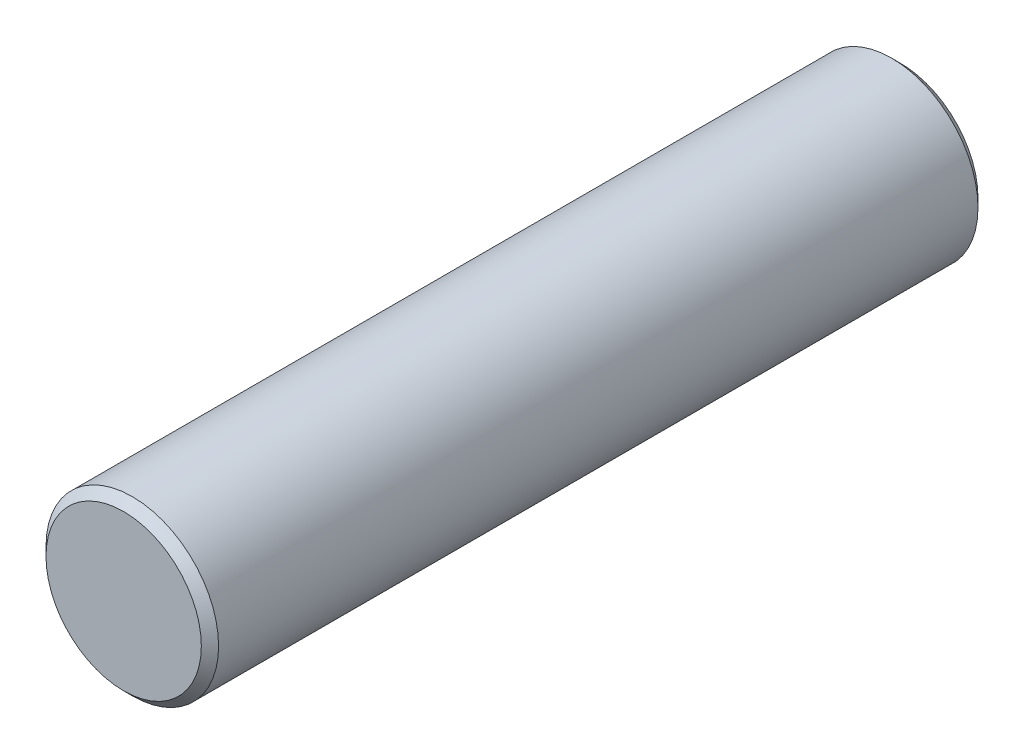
from build123d import *

# Parameters (mm, degrees)
EXTRUSION1_DEPTH      = 22.5
EXTRUSION1_DEPTH_BACK = 22.5
ESQUISSE1_R           = 5
CHANFREIN1_SIZE       = 0.5


with BuildPart() as part:
    # Esquisse1 → Extrusion1 (new, two sides: drawn at the far end of the back side and taken through both)
    with BuildSketch(Plane.XY.offset(-EXTRUSION1_DEPTH_BACK)):
        with Locations(Location((0, 0, 0), (0, 0, 180))):
            Circle(ESQUISSE1_R)
    extrude(amount=EXTRUSION1_DEPTH + EXTRUSION1_DEPTH_BACK)

    # Chanfrein1
    chanfrein1_edges = [part.edges().sort_by_distance(p)[0] for p in [
        (5, 0, -22.5),
        (5, 0, 22.5),
    ]]
    chamfer(chanfrein1_edges, length=CHANFREIN1_SIZE)


solid = part.part
